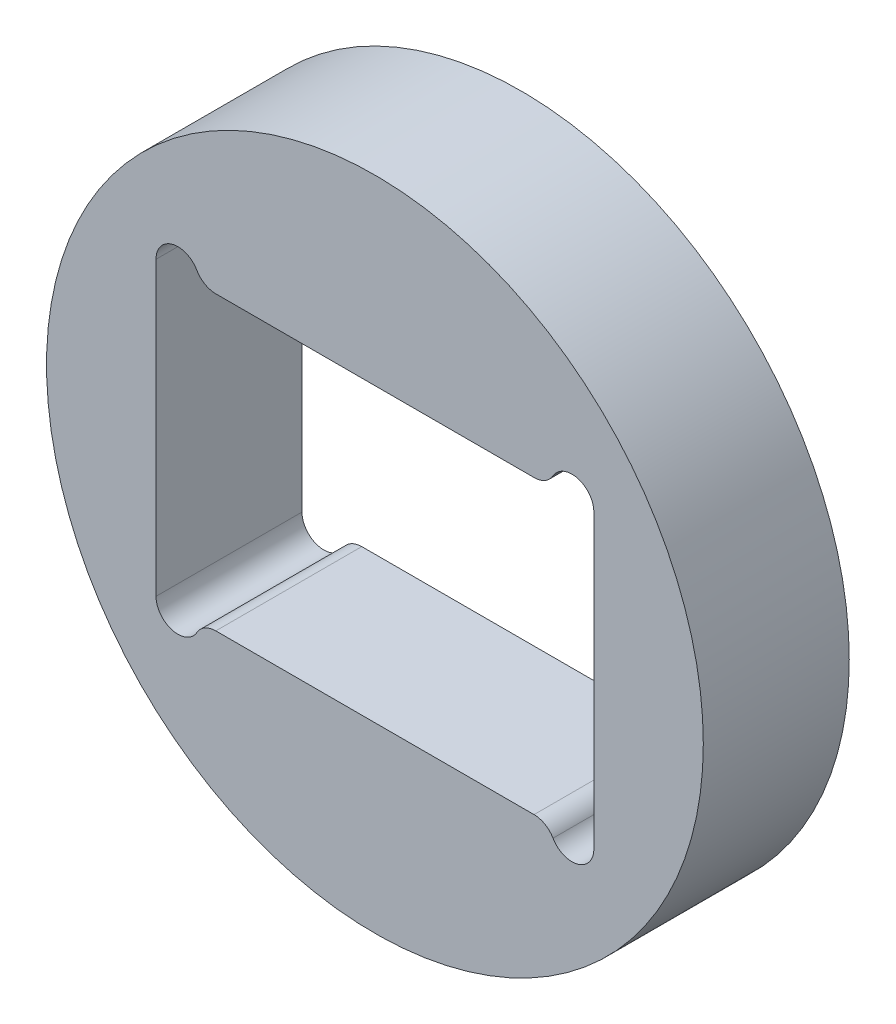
ISO-10303-21;
HEADER;
FILE_DESCRIPTION(('STEP AP214'),'2;1');
FILE_NAME('part.step','',(''),(''),'','','');
FILE_SCHEMA(('AUTOMOTIVE_DESIGN { 1 0 10303 214 1 1 1 1 }'));
ENDSEC;
DATA;
#1=APPLICATION_CONTEXT('core data for automotive mechanical design processes');
#2=APPLICATION_PROTOCOL_DEFINITION('international standard','automotive_design',2000,#1);
#3=PRODUCT_CONTEXT('',#1,'mechanical');
#4=PRODUCT('Part','Part','',(#3));
#5=PRODUCT_RELATED_PRODUCT_CATEGORY('part','',(#4));
#6=PRODUCT_DEFINITION_FORMATION('','',#4);
#7=PRODUCT_DEFINITION_CONTEXT('part definition',#1,'design');
#8=PRODUCT_DEFINITION('design','',#6,#7);
#9=PRODUCT_DEFINITION_SHAPE('','',#8);
#10=(LENGTH_UNIT() NAMED_UNIT(*) SI_UNIT(.MILLI.,.METRE.));
#11=(NAMED_UNIT(*) PLANE_ANGLE_UNIT() SI_UNIT($,.RADIAN.));
#12=(NAMED_UNIT(*) SI_UNIT($,.STERADIAN.) SOLID_ANGLE_UNIT());
#13=UNCERTAINTY_MEASURE_WITH_UNIT(LENGTH_MEASURE(1.E-05),#10,'distance_accuracy_value','');
#14=(GEOMETRIC_REPRESENTATION_CONTEXT(3) GLOBAL_UNCERTAINTY_ASSIGNED_CONTEXT((#13)) GLOBAL_UNIT_ASSIGNED_CONTEXT((#10,
#11,#12)) REPRESENTATION_CONTEXT('',''));
#15=CARTESIAN_POINT('',(0.,0.,0.));
#16=DIRECTION('',(0.,0.,1.));
#17=DIRECTION('',(1.,0.,0.));
#18=AXIS2_PLACEMENT_3D('',#15,#16,#17);
#19=CARTESIAN_POINT('',(-62.0464763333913,20.0201457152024,10.));
#20=DIRECTION('',(0.,0.,1.));
#21=DIRECTION('',(1.,0.,0.));
#22=AXIS2_PLACEMENT_3D('',#19,#20,#21);
#23=PLANE('',#22);
#24=CARTESIAN_POINT('',(-62.0464763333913,20.0201457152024,10.));
#25=DIRECTION('',(0.,0.,1.));
#26=DIRECTION('',(1.,0.,0.));
#27=AXIS2_PLACEMENT_3D('',#24,#25,#26);
#28=CIRCLE('',#27,22.5);
#29=CARTESIAN_POINT('',(-39.5464763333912,20.0201457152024,10.));
#30=VERTEX_POINT('',#29);
#31=EDGE_CURVE('E11',#30,#30,#28,.T.);
#32=ORIENTED_EDGE('',*,*,#31,.T.);
#33=EDGE_LOOP('',(#32));
#34=FACE_BOUND('',#33,.T.);
#35=DIRECTION('',(-1.,0.,0.));
#36=VECTOR('',#35,1.);
#37=CARTESIAN_POINT('',(-72.948400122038,30.0201457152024,10.));
#38=LINE('',#37,#36);
#39=CARTESIAN_POINT('',(-51.1445525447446,30.0201457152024,10.));
#40=VERTEX_POINT('',#39);
#41=CARTESIAN_POINT('',(-72.948400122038,30.0201457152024,10.));
#42=VERTEX_POINT('',#41);
#43=EDGE_CURVE('E144',#40,#42,#38,.T.);
#44=ORIENTED_EDGE('',*,*,#43,.F.);
#45=CARTESIAN_POINT('',(-51.1445525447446,31.5201457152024,10.));
#46=DIRECTION('',(0.,0.,-1.));
#47=DIRECTION('',(1.,0.,0.));
#48=AXIS2_PLACEMENT_3D('',#45,#46,#47);
#49=CIRCLE('',#48,1.5);
#50=CARTESIAN_POINT('',(-49.8455144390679,30.7701457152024,10.));
#51=VERTEX_POINT('',#50);
#52=EDGE_CURVE('E135',#51,#40,#49,.T.);
#53=ORIENTED_EDGE('',*,*,#52,.F.);
#54=CARTESIAN_POINT('',(-48.5464763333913,30.0201457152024,10.));
#55=DIRECTION('',(0.,0.,1.));
#56=DIRECTION('',(1.,0.,0.));
#57=AXIS2_PLACEMENT_3D('',#54,#55,#56);
#58=CIRCLE('',#57,1.5);
#59=CARTESIAN_POINT('',(-47.0464763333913,30.0201457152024,10.));
#60=VERTEX_POINT('',#59);
#61=EDGE_CURVE('E187',#60,#51,#58,.T.);
#62=ORIENTED_EDGE('',*,*,#61,.F.);
#63=DIRECTION('',(0.,1.,0.));
#64=VECTOR('',#63,1.);
#65=CARTESIAN_POINT('',(-47.0464763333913,30.0201457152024,10.));
#66=LINE('',#65,#64);
#67=CARTESIAN_POINT('',(-47.0464763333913,10.0201457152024,10.));
#68=VERTEX_POINT('',#67);
#69=EDGE_CURVE('E184',#68,#60,#66,.T.);
#70=ORIENTED_EDGE('',*,*,#69,.F.);
#71=CARTESIAN_POINT('',(-48.5464763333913,10.0201457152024,10.));
#72=DIRECTION('',(0.,0.,1.));
#73=DIRECTION('',(1.,0.,0.));
#74=AXIS2_PLACEMENT_3D('',#71,#72,#73);
#75=CIRCLE('',#74,1.5);
#76=CARTESIAN_POINT('',(-49.8455144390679,9.27014571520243,10.));
#77=VERTEX_POINT('',#76);
#78=EDGE_CURVE('E181',#77,#68,#75,.T.);
#79=ORIENTED_EDGE('',*,*,#78,.F.);
#80=CARTESIAN_POINT('',(-51.1445525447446,8.52014571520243,10.));
#81=DIRECTION('',(0.,0.,-1.));
#82=DIRECTION('',(1.,0.,0.));
#83=AXIS2_PLACEMENT_3D('',#80,#81,#82);
#84=CIRCLE('',#83,1.5);
#85=CARTESIAN_POINT('',(-51.1445525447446,10.0201457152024,10.));
#86=VERTEX_POINT('',#85);
#87=EDGE_CURVE('E178',#86,#77,#84,.T.);
#88=ORIENTED_EDGE('',*,*,#87,.F.);
#89=DIRECTION('',(1.,0.,0.));
#90=VECTOR('',#89,1.);
#91=CARTESIAN_POINT('',(-51.1445525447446,10.0201457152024,10.));
#92=LINE('',#91,#90);
#93=CARTESIAN_POINT('',(-72.948400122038,10.0201457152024,10.));
#94=VERTEX_POINT('',#93);
#95=EDGE_CURVE('E175',#94,#86,#92,.T.);
#96=ORIENTED_EDGE('',*,*,#95,.F.);
#97=CARTESIAN_POINT('',(-72.948400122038,8.52014571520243,10.));
#98=DIRECTION('',(0.,0.,-1.));
#99=DIRECTION('',(1.,0.,0.));
#100=AXIS2_PLACEMENT_3D('',#97,#98,#99);
#101=CIRCLE('',#100,1.5);
#102=CARTESIAN_POINT('',(-74.2474382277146,9.27014571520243,10.));
#103=VERTEX_POINT('',#102);
#104=EDGE_CURVE('E172',#103,#94,#101,.T.);
#105=ORIENTED_EDGE('',*,*,#104,.F.);
#106=CARTESIAN_POINT('',(-75.5464763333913,10.0201457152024,10.));
#107=DIRECTION('',(0.,0.,1.));
#108=DIRECTION('',(1.,0.,0.));
#109=AXIS2_PLACEMENT_3D('',#106,#107,#108);
#110=CIRCLE('',#109,1.5);
#111=CARTESIAN_POINT('',(-77.0464763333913,10.0201457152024,10.));
#112=VERTEX_POINT('',#111);
#113=EDGE_CURVE('E169',#112,#103,#110,.T.);
#114=ORIENTED_EDGE('',*,*,#113,.F.);
#115=DIRECTION('',(0.,-1.,0.));
#116=VECTOR('',#115,1.);
#117=CARTESIAN_POINT('',(-77.0464763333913,10.0201457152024,10.));
#118=LINE('',#117,#116);
#119=CARTESIAN_POINT('',(-77.0464763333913,30.0201457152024,10.));
#120=VERTEX_POINT('',#119);
#121=EDGE_CURVE('E166',#120,#112,#118,.T.);
#122=ORIENTED_EDGE('',*,*,#121,.F.);
#123=CARTESIAN_POINT('',(-75.5464763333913,30.0201457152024,10.));
#124=DIRECTION('',(0.,0.,1.));
#125=DIRECTION('',(1.,0.,0.));
#126=AXIS2_PLACEMENT_3D('',#123,#124,#125);
#127=CIRCLE('',#126,1.5);
#128=CARTESIAN_POINT('',(-74.2474382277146,30.7701457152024,10.));
#129=VERTEX_POINT('',#128);
#130=EDGE_CURVE('E161',#129,#120,#127,.T.);
#131=ORIENTED_EDGE('',*,*,#130,.F.);
#132=CARTESIAN_POINT('',(-72.948400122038,31.5201457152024,10.));
#133=DIRECTION('',(0.,0.,-1.));
#134=DIRECTION('',(1.,0.,0.));
#135=AXIS2_PLACEMENT_3D('',#132,#133,#134);
#136=CIRCLE('',#135,1.5);
#137=EDGE_CURVE('E157',#42,#129,#136,.T.);
#138=ORIENTED_EDGE('',*,*,#137,.F.);
#139=EDGE_LOOP('',(#44,#53,#62,#70,#79,#88,#96,#105,#114,#122,#131,#138));
#140=FACE_BOUND('',#139,.T.);
#141=ADVANCED_FACE('F45',(#34,#140),#23,.T.);
#142=CARTESIAN_POINT('',(-62.0464763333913,20.0201457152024,0.));
#143=DIRECTION('',(0.,0.,1.));
#144=DIRECTION('',(1.,0.,0.));
#145=AXIS2_PLACEMENT_3D('',#142,#143,#144);
#146=PLANE('',#145);
#147=CARTESIAN_POINT('',(-62.0464763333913,20.0201457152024,0.));
#148=DIRECTION('',(0.,0.,1.));
#149=DIRECTION('',(1.,0.,0.));
#150=AXIS2_PLACEMENT_3D('',#147,#148,#149);
#151=CIRCLE('',#150,22.5);
#152=CARTESIAN_POINT('',(-39.5464763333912,20.0201457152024,0.));
#153=VERTEX_POINT('',#152);
#154=EDGE_CURVE('E49',#153,#153,#151,.T.);
#155=ORIENTED_EDGE('',*,*,#154,.F.);
#156=EDGE_LOOP('',(#155));
#157=FACE_BOUND('',#156,.T.);
#158=CARTESIAN_POINT('',(-51.1445525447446,31.5201457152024,0.));
#159=DIRECTION('',(0.,0.,-1.));
#160=DIRECTION('',(1.,0.,0.));
#161=AXIS2_PLACEMENT_3D('',#158,#159,#160);
#162=CIRCLE('',#161,1.5);
#163=CARTESIAN_POINT('',(-49.8455144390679,30.7701457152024,0.));
#164=VERTEX_POINT('',#163);
#165=CARTESIAN_POINT('',(-51.1445525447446,30.0201457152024,0.));
#166=VERTEX_POINT('',#165);
#167=EDGE_CURVE('E69',#164,#166,#162,.T.);
#168=ORIENTED_EDGE('',*,*,#167,.T.);
#169=DIRECTION('',(-1.,0.,0.));
#170=VECTOR('',#169,1.);
#171=CARTESIAN_POINT('',(-72.948400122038,30.0201457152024,0.));
#172=LINE('',#171,#170);
#173=CARTESIAN_POINT('',(-72.948400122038,30.0201457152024,0.));
#174=VERTEX_POINT('',#173);
#175=EDGE_CURVE('E151',#166,#174,#172,.T.);
#176=ORIENTED_EDGE('',*,*,#175,.T.);
#177=CARTESIAN_POINT('',(-72.948400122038,31.5201457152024,0.));
#178=DIRECTION('',(0.,0.,-1.));
#179=DIRECTION('',(1.,0.,0.));
#180=AXIS2_PLACEMENT_3D('',#177,#178,#179);
#181=CIRCLE('',#180,1.5);
#182=CARTESIAN_POINT('',(-74.2474382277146,30.7701457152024,0.));
#183=VERTEX_POINT('',#182);
#184=EDGE_CURVE('E194',#174,#183,#181,.T.);
#185=ORIENTED_EDGE('',*,*,#184,.T.);
#186=CARTESIAN_POINT('',(-75.5464763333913,30.0201457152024,0.));
#187=DIRECTION('',(0.,0.,1.));
#188=DIRECTION('',(1.,0.,0.));
#189=AXIS2_PLACEMENT_3D('',#186,#187,#188);
#190=CIRCLE('',#189,1.5);
#191=CARTESIAN_POINT('',(-77.0464763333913,30.0201457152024,0.));
#192=VERTEX_POINT('',#191);
#193=EDGE_CURVE('E198',#183,#192,#190,.T.);
#194=ORIENTED_EDGE('',*,*,#193,.T.);
#195=DIRECTION('',(0.,-1.,0.));
#196=VECTOR('',#195,1.);
#197=CARTESIAN_POINT('',(-77.0464763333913,10.0201457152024,0.));
#198=LINE('',#197,#196);
#199=CARTESIAN_POINT('',(-77.0464763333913,10.0201457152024,0.));
#200=VERTEX_POINT('',#199);
#201=EDGE_CURVE('E202',#192,#200,#198,.T.);
#202=ORIENTED_EDGE('',*,*,#201,.T.);
#203=CARTESIAN_POINT('',(-75.5464763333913,10.0201457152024,0.));
#204=DIRECTION('',(0.,0.,1.));
#205=DIRECTION('',(1.,0.,0.));
#206=AXIS2_PLACEMENT_3D('',#203,#204,#205);
#207=CIRCLE('',#206,1.5);
#208=CARTESIAN_POINT('',(-74.2474382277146,9.27014571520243,0.));
#209=VERTEX_POINT('',#208);
#210=EDGE_CURVE('E206',#200,#209,#207,.T.);
#211=ORIENTED_EDGE('',*,*,#210,.T.);
#212=CARTESIAN_POINT('',(-72.948400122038,8.52014571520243,0.));
#213=DIRECTION('',(0.,0.,-1.));
#214=DIRECTION('',(1.,0.,0.));
#215=AXIS2_PLACEMENT_3D('',#212,#213,#214);
#216=CIRCLE('',#215,1.5);
#217=CARTESIAN_POINT('',(-72.948400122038,10.0201457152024,0.));
#218=VERTEX_POINT('',#217);
#219=EDGE_CURVE('E210',#209,#218,#216,.T.);
#220=ORIENTED_EDGE('',*,*,#219,.T.);
#221=DIRECTION('',(1.,0.,0.));
#222=VECTOR('',#221,1.);
#223=CARTESIAN_POINT('',(-51.1445525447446,10.0201457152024,0.));
#224=LINE('',#223,#222);
#225=CARTESIAN_POINT('',(-51.1445525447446,10.0201457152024,0.));
#226=VERTEX_POINT('',#225);
#227=EDGE_CURVE('E214',#218,#226,#224,.T.);
#228=ORIENTED_EDGE('',*,*,#227,.T.);
#229=CARTESIAN_POINT('',(-51.1445525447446,8.52014571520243,0.));
#230=DIRECTION('',(0.,0.,-1.));
#231=DIRECTION('',(1.,0.,0.));
#232=AXIS2_PLACEMENT_3D('',#229,#230,#231);
#233=CIRCLE('',#232,1.5);
#234=CARTESIAN_POINT('',(-49.8455144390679,9.27014571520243,0.));
#235=VERTEX_POINT('',#234);
#236=EDGE_CURVE('E218',#226,#235,#233,.T.);
#237=ORIENTED_EDGE('',*,*,#236,.T.);
#238=CARTESIAN_POINT('',(-48.5464763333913,10.0201457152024,0.));
#239=DIRECTION('',(0.,0.,1.));
#240=DIRECTION('',(1.,0.,0.));
#241=AXIS2_PLACEMENT_3D('',#238,#239,#240);
#242=CIRCLE('',#241,1.5);
#243=CARTESIAN_POINT('',(-47.0464763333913,10.0201457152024,0.));
#244=VERTEX_POINT('',#243);
#245=EDGE_CURVE('E222',#235,#244,#242,.T.);
#246=ORIENTED_EDGE('',*,*,#245,.T.);
#247=DIRECTION('',(0.,1.,0.));
#248=VECTOR('',#247,1.);
#249=CARTESIAN_POINT('',(-47.0464763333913,30.0201457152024,0.));
#250=LINE('',#249,#248);
#251=CARTESIAN_POINT('',(-47.0464763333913,30.0201457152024,0.));
#252=VERTEX_POINT('',#251);
#253=EDGE_CURVE('E226',#244,#252,#250,.T.);
#254=ORIENTED_EDGE('',*,*,#253,.T.);
#255=CARTESIAN_POINT('',(-48.5464763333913,30.0201457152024,0.));
#256=DIRECTION('',(0.,0.,1.));
#257=DIRECTION('',(1.,0.,0.));
#258=AXIS2_PLACEMENT_3D('',#255,#256,#257);
#259=CIRCLE('',#258,1.5);
#260=EDGE_CURVE('E145',#252,#164,#259,.T.);
#261=ORIENTED_EDGE('',*,*,#260,.T.);
#262=EDGE_LOOP('',(#168,#176,#185,#194,#202,#211,#220,#228,#237,#246,#254,#261));
#263=FACE_BOUND('',#262,.T.);
#264=ADVANCED_FACE('F268',(#157,#263),#146,.F.);
#265=CARTESIAN_POINT('',(-62.0464763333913,20.0201457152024,10.));
#266=DIRECTION('',(0.,0.,-1.));
#267=DIRECTION('',(-1.,0.,0.));
#268=AXIS2_PLACEMENT_3D('',#265,#266,#267);
#269=CYLINDRICAL_SURFACE('',#268,22.5);
#270=ORIENTED_EDGE('',*,*,#31,.F.);
#271=EDGE_LOOP('',(#270));
#272=FACE_BOUND('',#271,.T.);
#273=ORIENTED_EDGE('',*,*,#154,.T.);
#274=EDGE_LOOP('',(#273));
#275=FACE_BOUND('',#274,.T.);
#276=ADVANCED_FACE('F47',(#272,#275),#269,.T.);
#277=CARTESIAN_POINT('',(-51.1445525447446,31.5201457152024,10.));
#278=DIRECTION('',(0.,0.,-1.));
#279=DIRECTION('',(-1.,0.,0.));
#280=AXIS2_PLACEMENT_3D('',#277,#278,#279);
#281=CYLINDRICAL_SURFACE('',#280,1.5);
#282=ORIENTED_EDGE('',*,*,#167,.F.);
#283=DIRECTION('',(0.,0.,-1.));
#284=VECTOR('',#283,1.);
#285=CARTESIAN_POINT('',(-49.8455144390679,30.7701457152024,10.));
#286=LINE('',#285,#284);
#287=EDGE_CURVE('E139',#51,#164,#286,.T.);
#288=ORIENTED_EDGE('',*,*,#287,.F.);
#289=ORIENTED_EDGE('',*,*,#52,.T.);
#290=DIRECTION('',(0.,0.,-1.));
#291=VECTOR('',#290,1.);
#292=CARTESIAN_POINT('',(-51.1445525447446,30.0201457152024,10.));
#293=LINE('',#292,#291);
#294=EDGE_CURVE('E138',#40,#166,#293,.T.);
#295=ORIENTED_EDGE('',*,*,#294,.T.);
#296=EDGE_LOOP('',(#282,#288,#289,#295));
#297=FACE_BOUND('',#296,.T.);
#298=ADVANCED_FACE('F137',(#297),#281,.T.);
#299=CARTESIAN_POINT('',(-72.948400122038,30.0201457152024,10.));
#300=DIRECTION('',(0.,-1.,0.));
#301=DIRECTION('',(0.,0.,-1.));
#302=AXIS2_PLACEMENT_3D('',#299,#300,#301);
#303=PLANE('',#302);
#304=ORIENTED_EDGE('',*,*,#175,.F.);
#305=ORIENTED_EDGE('',*,*,#294,.F.);
#306=ORIENTED_EDGE('',*,*,#43,.T.);
#307=DIRECTION('',(0.,0.,-1.));
#308=VECTOR('',#307,1.);
#309=CARTESIAN_POINT('',(-72.948400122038,30.0201457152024,10.));
#310=LINE('',#309,#308);
#311=EDGE_CURVE('E153',#42,#174,#310,.T.);
#312=ORIENTED_EDGE('',*,*,#311,.T.);
#313=EDGE_LOOP('',(#304,#305,#306,#312));
#314=FACE_BOUND('',#313,.T.);
#315=ADVANCED_FACE('F148',(#314),#303,.T.);
#316=CARTESIAN_POINT('',(-72.948400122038,31.5201457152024,10.));
#317=DIRECTION('',(0.,0.,-1.));
#318=DIRECTION('',(-1.,0.,0.));
#319=AXIS2_PLACEMENT_3D('',#316,#317,#318);
#320=CYLINDRICAL_SURFACE('',#319,1.5);
#321=ORIENTED_EDGE('',*,*,#184,.F.);
#322=ORIENTED_EDGE('',*,*,#311,.F.);
#323=ORIENTED_EDGE('',*,*,#137,.T.);
#324=DIRECTION('',(0.,0.,-1.));
#325=VECTOR('',#324,1.);
#326=CARTESIAN_POINT('',(-74.2474382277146,30.7701457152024,10.));
#327=LINE('',#326,#325);
#328=EDGE_CURVE('E258',#129,#183,#327,.T.);
#329=ORIENTED_EDGE('',*,*,#328,.T.);
#330=EDGE_LOOP('',(#321,#322,#323,#329));
#331=FACE_BOUND('',#330,.T.);
#332=ADVANCED_FACE('F264',(#331),#320,.T.);
#333=CARTESIAN_POINT('',(-75.5464763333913,30.0201457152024,10.));
#334=DIRECTION('',(0.,0.,-1.));
#335=DIRECTION('',(-1.,0.,0.));
#336=AXIS2_PLACEMENT_3D('',#333,#334,#335);
#337=CYLINDRICAL_SURFACE('',#336,1.5);
#338=ORIENTED_EDGE('',*,*,#193,.F.);
#339=ORIENTED_EDGE('',*,*,#328,.F.);
#340=ORIENTED_EDGE('',*,*,#130,.T.);
#341=DIRECTION('',(0.,0.,-1.));
#342=VECTOR('',#341,1.);
#343=CARTESIAN_POINT('',(-77.0464763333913,30.0201457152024,10.));
#344=LINE('',#343,#342);
#345=EDGE_CURVE('E255',#120,#192,#344,.T.);
#346=ORIENTED_EDGE('',*,*,#345,.T.);
#347=EDGE_LOOP('',(#338,#339,#340,#346));
#348=FACE_BOUND('',#347,.T.);
#349=ADVANCED_FACE('F306',(#348),#337,.F.);
#350=CARTESIAN_POINT('',(-77.0464763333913,10.0201457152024,10.));
#351=DIRECTION('',(1.,0.,0.));
#352=DIRECTION('',(0.,1.,0.));
#353=AXIS2_PLACEMENT_3D('',#350,#351,#352);
#354=PLANE('',#353);
#355=ORIENTED_EDGE('',*,*,#201,.F.);
#356=ORIENTED_EDGE('',*,*,#345,.F.);
#357=ORIENTED_EDGE('',*,*,#121,.T.);
#358=DIRECTION('',(0.,0.,-1.));
#359=VECTOR('',#358,1.);
#360=CARTESIAN_POINT('',(-77.0464763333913,10.0201457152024,10.));
#361=LINE('',#360,#359);
#362=EDGE_CURVE('E252',#112,#200,#361,.T.);
#363=ORIENTED_EDGE('',*,*,#362,.T.);
#364=EDGE_LOOP('',(#355,#356,#357,#363));
#365=FACE_BOUND('',#364,.T.);
#366=ADVANCED_FACE('F304',(#365),#354,.T.);
#367=CARTESIAN_POINT('',(-75.5464763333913,10.0201457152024,10.));
#368=DIRECTION('',(0.,0.,-1.));
#369=DIRECTION('',(-1.,0.,0.));
#370=AXIS2_PLACEMENT_3D('',#367,#368,#369);
#371=CYLINDRICAL_SURFACE('',#370,1.5);
#372=ORIENTED_EDGE('',*,*,#210,.F.);
#373=ORIENTED_EDGE('',*,*,#362,.F.);
#374=ORIENTED_EDGE('',*,*,#113,.T.);
#375=DIRECTION('',(0.,0.,-1.));
#376=VECTOR('',#375,1.);
#377=CARTESIAN_POINT('',(-74.2474382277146,9.27014571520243,10.));
#378=LINE('',#377,#376);
#379=EDGE_CURVE('E249',#103,#209,#378,.T.);
#380=ORIENTED_EDGE('',*,*,#379,.T.);
#381=EDGE_LOOP('',(#372,#373,#374,#380));
#382=FACE_BOUND('',#381,.T.);
#383=ADVANCED_FACE('F298',(#382),#371,.F.);
#384=CARTESIAN_POINT('',(-72.948400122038,8.52014571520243,10.));
#385=DIRECTION('',(0.,0.,-1.));
#386=DIRECTION('',(-1.,0.,0.));
#387=AXIS2_PLACEMENT_3D('',#384,#385,#386);
#388=CYLINDRICAL_SURFACE('',#387,1.5);
#389=ORIENTED_EDGE('',*,*,#219,.F.);
#390=ORIENTED_EDGE('',*,*,#379,.F.);
#391=ORIENTED_EDGE('',*,*,#104,.T.);
#392=DIRECTION('',(0.,0.,-1.));
#393=VECTOR('',#392,1.);
#394=CARTESIAN_POINT('',(-72.948400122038,10.0201457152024,10.));
#395=LINE('',#394,#393);
#396=EDGE_CURVE('E246',#94,#218,#395,.T.);
#397=ORIENTED_EDGE('',*,*,#396,.T.);
#398=EDGE_LOOP('',(#389,#390,#391,#397));
#399=FACE_BOUND('',#398,.T.);
#400=ADVANCED_FACE('F294',(#399),#388,.T.);
#401=CARTESIAN_POINT('',(-51.1445525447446,10.0201457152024,10.));
#402=DIRECTION('',(0.,1.,0.));
#403=DIRECTION('',(-1.,0.,0.));
#404=AXIS2_PLACEMENT_3D('',#401,#402,#403);
#405=PLANE('',#404);
#406=ORIENTED_EDGE('',*,*,#227,.F.);
#407=ORIENTED_EDGE('',*,*,#396,.F.);
#408=ORIENTED_EDGE('',*,*,#95,.T.);
#409=DIRECTION('',(0.,0.,-1.));
#410=VECTOR('',#409,1.);
#411=CARTESIAN_POINT('',(-51.1445525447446,10.0201457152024,10.));
#412=LINE('',#411,#410);
#413=EDGE_CURVE('E243',#86,#226,#412,.T.);
#414=ORIENTED_EDGE('',*,*,#413,.T.);
#415=EDGE_LOOP('',(#406,#407,#408,#414));
#416=FACE_BOUND('',#415,.T.);
#417=ADVANCED_FACE('F291',(#416),#405,.T.);
#418=CARTESIAN_POINT('',(-51.1445525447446,8.52014571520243,10.));
#419=DIRECTION('',(0.,0.,-1.));
#420=DIRECTION('',(-1.,0.,0.));
#421=AXIS2_PLACEMENT_3D('',#418,#419,#420);
#422=CYLINDRICAL_SURFACE('',#421,1.5);
#423=ORIENTED_EDGE('',*,*,#236,.F.);
#424=ORIENTED_EDGE('',*,*,#413,.F.);
#425=ORIENTED_EDGE('',*,*,#87,.T.);
#426=DIRECTION('',(0.,0.,-1.));
#427=VECTOR('',#426,1.);
#428=CARTESIAN_POINT('',(-49.8455144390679,9.27014571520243,10.));
#429=LINE('',#428,#427);
#430=EDGE_CURVE('E240',#77,#235,#429,.T.);
#431=ORIENTED_EDGE('',*,*,#430,.T.);
#432=EDGE_LOOP('',(#423,#424,#425,#431));
#433=FACE_BOUND('',#432,.T.);
#434=ADVANCED_FACE('F283',(#433),#422,.T.);
#435=CARTESIAN_POINT('',(-48.5464763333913,10.0201457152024,10.));
#436=DIRECTION('',(0.,0.,-1.));
#437=DIRECTION('',(-1.,0.,0.));
#438=AXIS2_PLACEMENT_3D('',#435,#436,#437);
#439=CYLINDRICAL_SURFACE('',#438,1.5);
#440=ORIENTED_EDGE('',*,*,#245,.F.);
#441=ORIENTED_EDGE('',*,*,#430,.F.);
#442=ORIENTED_EDGE('',*,*,#78,.T.);
#443=DIRECTION('',(0.,0.,-1.));
#444=VECTOR('',#443,1.);
#445=CARTESIAN_POINT('',(-47.0464763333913,10.0201457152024,10.));
#446=LINE('',#445,#444);
#447=EDGE_CURVE('E237',#68,#244,#446,.T.);
#448=ORIENTED_EDGE('',*,*,#447,.T.);
#449=EDGE_LOOP('',(#440,#441,#442,#448));
#450=FACE_BOUND('',#449,.T.);
#451=ADVANCED_FACE('F279',(#450),#439,.F.);
#452=CARTESIAN_POINT('',(-47.0464763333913,30.0201457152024,10.));
#453=DIRECTION('',(-1.,0.,0.));
#454=DIRECTION('',(0.,-1.,0.));
#455=AXIS2_PLACEMENT_3D('',#452,#453,#454);
#456=PLANE('',#455);
#457=ORIENTED_EDGE('',*,*,#253,.F.);
#458=ORIENTED_EDGE('',*,*,#447,.F.);
#459=ORIENTED_EDGE('',*,*,#69,.T.);
#460=DIRECTION('',(0.,0.,-1.));
#461=VECTOR('',#460,1.);
#462=CARTESIAN_POINT('',(-47.0464763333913,30.0201457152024,10.));
#463=LINE('',#462,#461);
#464=EDGE_CURVE('E61',#60,#252,#463,.T.);
#465=ORIENTED_EDGE('',*,*,#464,.T.);
#466=EDGE_LOOP('',(#457,#458,#459,#465));
#467=FACE_BOUND('',#466,.T.);
#468=ADVANCED_FACE('F276',(#467),#456,.T.);
#469=CARTESIAN_POINT('',(-48.5464763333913,30.0201457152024,10.));
#470=DIRECTION('',(0.,0.,-1.));
#471=DIRECTION('',(-1.,0.,0.));
#472=AXIS2_PLACEMENT_3D('',#469,#470,#471);
#473=CYLINDRICAL_SURFACE('',#472,1.5);
#474=ORIENTED_EDGE('',*,*,#260,.F.);
#475=ORIENTED_EDGE('',*,*,#464,.F.);
#476=ORIENTED_EDGE('',*,*,#61,.T.);
#477=ORIENTED_EDGE('',*,*,#287,.T.);
#478=EDGE_LOOP('',(#474,#475,#476,#477));
#479=FACE_BOUND('',#478,.T.);
#480=ADVANCED_FACE('F270',(#479),#473,.F.);
#481=CLOSED_SHELL('',(#141,#264,#276,#298,#315,#332,#349,#366,#383,#400,#417,#434,#451,#468,#480));
#482=MANIFOLD_SOLID_BREP('B2',#481);
#483=ADVANCED_BREP_SHAPE_REPRESENTATION('',(#18,#482),#14);
#484=SHAPE_DEFINITION_REPRESENTATION(#9,#483);
ENDSEC;
END-ISO-10303-21;
